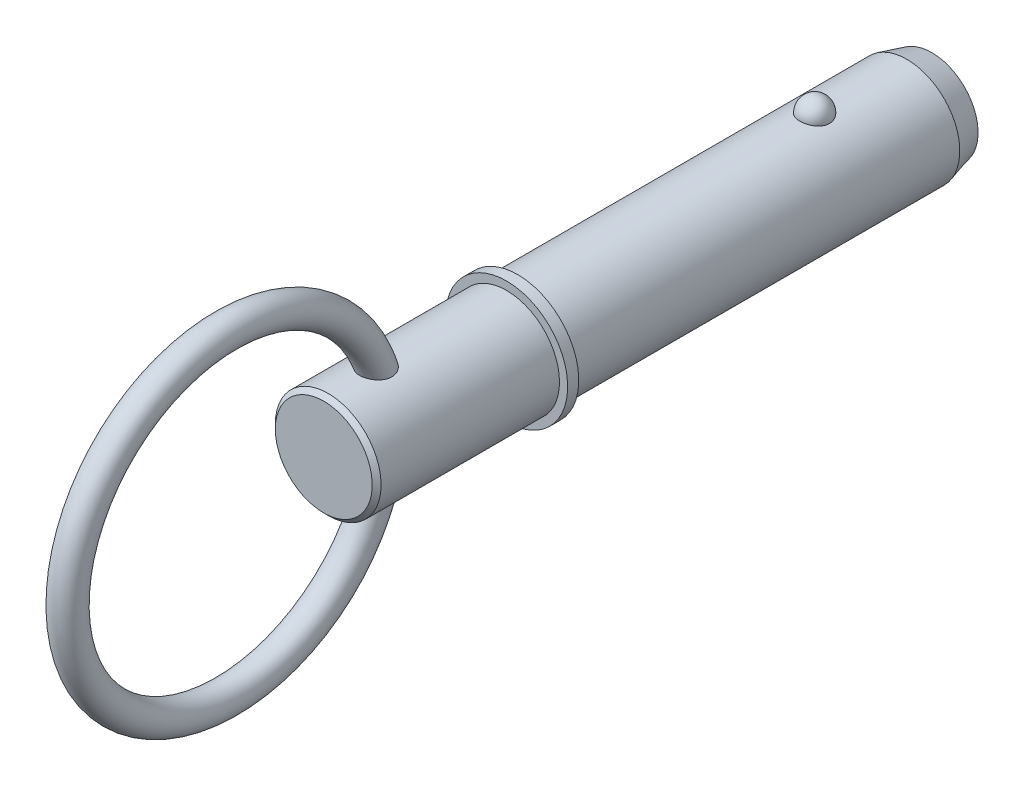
from build123d import *

# Parameters (mm, degrees)
SKETCH2_R           = 9.525
BOSS_EXTRUDE1_DEPTH = 50.8
BOSS_EXTRUDE2_START = 23.8
SKETCH3_R           = 9.525
BOSS_EXTRUDE2_DEPTH = 23.8
CHAMFER1_SIZE       = 4.5
CHAMFER1_SIZE2      = 1.205771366
SKETCH20_W          = 2
SKETCH20_H          = 11
SKETCH21_R          = 9.525
BOSS_EXTRUDE3_DEPTH = 34.93
CHAMFER2_SIZE       = 0.8
SKETCH24_R          = 2.75


with BuildPart() as part:
    # Sketch2 → Boss-Extrude1 (new body)
    with BuildSketch(Plane.XY):
        Circle(SKETCH2_R)
    extrude(amount=BOSS_EXTRUDE1_DEPTH)

    # Sketch3 → Boss-Extrude2 (add)
    with BuildSketch(Plane(origin=(0, 0, 0), x_dir=(-1, 0, 0), z_dir=(0, 0, -1)).offset(BOSS_EXTRUDE2_START)):
        Circle(SKETCH3_R)
    extrude(amount=-BOSS_EXTRUDE2_DEPTH)

    # Chamfer1
    chamfer1_edges = [part.edges().sort_by_distance(p)[0] for p in [
        (9.525, 0, -23.8),
    ]]
    chamfer1_side = [part.faces().sort_by_distance(p)[0] for p in [
        (9.525, 0, -11.9),
    ]]
    chamfer(chamfer1_edges, length=CHAMFER1_SIZE, length2=CHAMFER1_SIZE2, reference=chamfer1_side[0])

    # Sketch18 → Revolve1 (revolve)
    with BuildSketch(Plane(origin=(0, 0, 0), x_dir=(0, 0, -1), z_dir=(1, 0, 0))):
        with BuildLine():
            Line((2.69, 12.215), (2.69, 6.835))
            ThreePointArc((2.69, 6.835), (0, 9.525), (2.69, 12.215))
        make_face()
    revolve(axis=Axis((0, 12.215, -2.69), (0, -1, 0)))

    # Sketch20 → Revolve2 (revolve)
    with BuildSketch(Plane(origin=(0, 0, 0), x_dir=(0, 0, -1), z_dir=(1, 0, 0)), mode=Mode.PRIVATE) as revolve2_sk:
        with Locations((-51.8, 5.5)):
            Rectangle(SKETCH20_W, SKETCH20_H)
    revolve(revolve2_sk.sketch.rotate(Axis((0, 0, 33.728787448), (0, 0, 1)), 90), axis=Axis((0, 0, 33.728787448), (0, 0, 1)))

    # Sketch21 → Boss-Extrude3 (add)
    with BuildSketch(Plane(origin=(0, 0, 50.8), x_dir=(-1, 0, 0), z_dir=(0, 0, -1))):
        Circle(SKETCH21_R)
    extrude(amount=-BOSS_EXTRUDE3_DEPTH)

    # Chamfer2
    chamfer2_edges = [part.edges().sort_by_distance(p)[0] for p in [
        (9.525, 0, 85.73),
    ]]
    chamfer(chamfer2_edges, length=CHAMFER2_SIZE)

    # Sweep1: sweep along a path in Sketch23
    with BuildLine(Plane(origin=(0, 0, 0), x_dir=(0, 0, -1), z_dir=(1, 0, 0))) as sweep1_path:
        CenterArc((-103.305, 0), 28.575, 0, 360)
    # Sketch24 → Sweep1 (sweep)
    with BuildSketch(Plane(origin=(0, 0, 0), x_dir=(1, 0, 0), z_dir=(0, 1, 0))):
        with Locations((0, -74.73)):
            Circle(SKETCH24_R)
    sweep(path=sweep1_path.line)


solid = part.part
